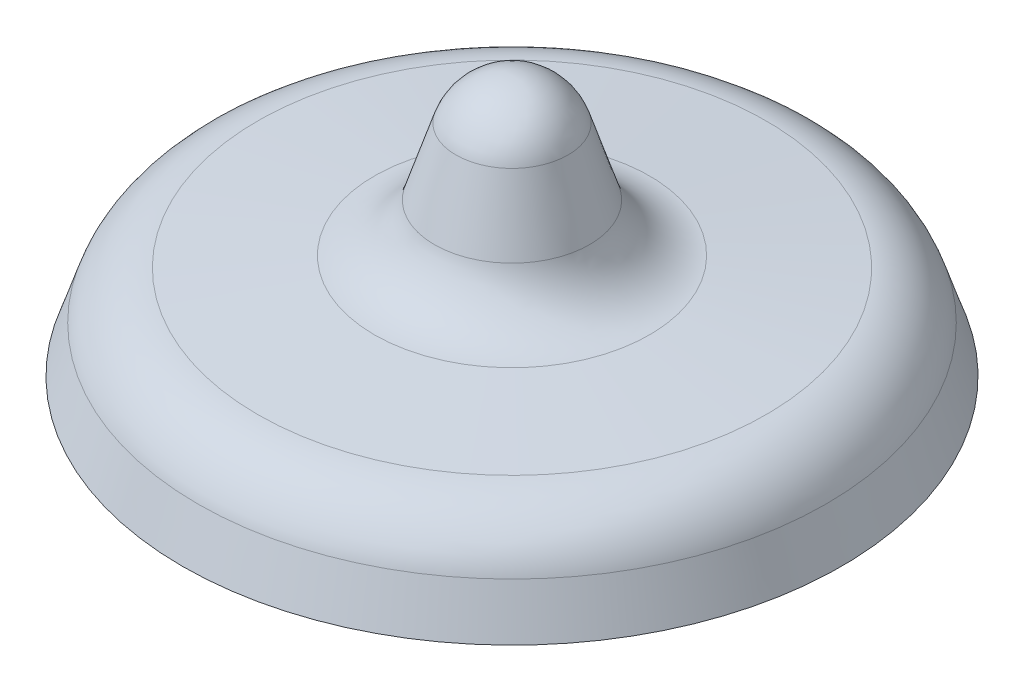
ISO-10303-21;
HEADER;
FILE_DESCRIPTION(('STEP AP214'),'2;1');
FILE_NAME('part.step','',(''),(''),'','','');
FILE_SCHEMA(('AUTOMOTIVE_DESIGN { 1 0 10303 214 1 1 1 1 }'));
ENDSEC;
DATA;
#1=APPLICATION_CONTEXT('core data for automotive mechanical design processes');
#2=APPLICATION_PROTOCOL_DEFINITION('international standard','automotive_design',2000,#1);
#3=PRODUCT_CONTEXT('',#1,'mechanical');
#4=PRODUCT('Part','Part','',(#3));
#5=PRODUCT_RELATED_PRODUCT_CATEGORY('part','',(#4));
#6=PRODUCT_DEFINITION_FORMATION('','',#4);
#7=PRODUCT_DEFINITION_CONTEXT('part definition',#1,'design');
#8=PRODUCT_DEFINITION('design','',#6,#7);
#9=PRODUCT_DEFINITION_SHAPE('','',#8);
#10=(LENGTH_UNIT() NAMED_UNIT(*) SI_UNIT(.MILLI.,.METRE.));
#11=(NAMED_UNIT(*) PLANE_ANGLE_UNIT() SI_UNIT($,.RADIAN.));
#12=(NAMED_UNIT(*) SI_UNIT($,.STERADIAN.) SOLID_ANGLE_UNIT());
#13=UNCERTAINTY_MEASURE_WITH_UNIT(LENGTH_MEASURE(1.E-05),#10,'distance_accuracy_value','');
#14=(GEOMETRIC_REPRESENTATION_CONTEXT(3) GLOBAL_UNCERTAINTY_ASSIGNED_CONTEXT((#13)) GLOBAL_UNIT_ASSIGNED_CONTEXT((#10,
#11,#12)) REPRESENTATION_CONTEXT('',''));
#15=CARTESIAN_POINT('',(0.,0.,0.));
#16=DIRECTION('',(0.,0.,1.));
#17=DIRECTION('',(1.,0.,0.));
#18=AXIS2_PLACEMENT_3D('',#15,#16,#17);
#19=CARTESIAN_POINT('',(0.,0.,0.));
#20=DIRECTION('',(0.,1.,0.));
#21=DIRECTION('',(0.,0.,1.));
#22=AXIS2_PLACEMENT_3D('',#19,#20,#21);
#23=PLANE('',#22);
#24=CARTESIAN_POINT('',(0.,0.,0.));
#25=DIRECTION('',(0.,1.,0.));
#26=DIRECTION('',(0.,0.,1.));
#27=AXIS2_PLACEMENT_3D('',#24,#25,#26);
#28=CIRCLE('',#27,111.581714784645);
#29=CARTESIAN_POINT('',(0.,0.,111.581714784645));
#30=VERTEX_POINT('',#29);
#31=EDGE_CURVE('E10',#30,#30,#28,.T.);
#32=ORIENTED_EDGE('',*,*,#31,.F.);
#33=EDGE_LOOP('',(#32));
#34=FACE_BOUND('',#33,.T.);
#35=ADVANCED_FACE('F42',(#34),#23,.F.);
#36=CARTESIAN_POINT('',(0.,0.,0.));
#37=DIRECTION('',(0.,-1.,0.));
#38=DIRECTION('',(0.,0.,-1.));
#39=AXIS2_PLACEMENT_3D('',#36,#37,#38);
#40=CONICAL_SURFACE('',#39,111.581714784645,0.320474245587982);
#41=CARTESIAN_POINT('',(0.,15.686559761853,0.));
#42=DIRECTION('',(0.,1.,0.));
#43=DIRECTION('',(0.,0.,1.));
#44=AXIS2_PLACEMENT_3D('',#41,#42,#43);
#45=CIRCLE('',#44,106.375097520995);
#46=CARTESIAN_POINT('',(0.,15.686559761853,106.375097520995));
#47=VERTEX_POINT('',#46);
#48=EDGE_CURVE('E49',#47,#47,#45,.T.);
#49=ORIENTED_EDGE('',*,*,#48,.F.);
#50=EDGE_LOOP('',(#49));
#51=FACE_BOUND('',#50,.T.);
#52=ORIENTED_EDGE('',*,*,#31,.T.);
#53=EDGE_LOOP('',(#52));
#54=FACE_BOUND('',#53,.T.);
#55=ADVANCED_FACE('F93',(#51,#54),#40,.T.);
#56=CARTESIAN_POINT('',(0.,8.24328760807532,0.));
#57=DIRECTION('',(0.,1.,0.));
#58=DIRECTION('',(0.,0.,1.));
#59=AXIS2_PLACEMENT_3D('',#56,#57,#58);
#60=TOROIDAL_SURFACE('',#59,83.9499167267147,23.6281830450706);
#61=CARTESIAN_POINT('',(0.,31.7726805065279,0.));
#62=DIRECTION('',(0.,1.,0.));
#63=DIRECTION('',(0.,0.,1.));
#64=AXIS2_PLACEMENT_3D('',#61,#62,#63);
#65=CIRCLE('',#64,86.108319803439);
#66=CARTESIAN_POINT('',(0.,31.7726805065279,86.108319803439));
#67=VERTEX_POINT('',#66);
#68=EDGE_CURVE('E54',#67,#67,#65,.T.);
#69=ORIENTED_EDGE('',*,*,#68,.F.);
#70=EDGE_LOOP('',(#69));
#71=FACE_BOUND('',#70,.T.);
#72=ORIENTED_EDGE('',*,*,#48,.T.);
#73=EDGE_LOOP('',(#72));
#74=FACE_BOUND('',#73,.T.);
#75=ADVANCED_FACE('F88',(#71,#74),#60,.T.);
#76=CARTESIAN_POINT('',(0.,31.7726805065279,0.));
#77=DIRECTION('',(0.,-1.,0.));
#78=DIRECTION('',(0.,0.,-1.));
#79=AXIS2_PLACEMENT_3D('',#76,#77,#78);
#80=CONICAL_SURFACE('',#79,86.108319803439,1.47932013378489);
#81=CARTESIAN_POINT('',(0.,35.3968974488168,0.));
#82=DIRECTION('',(0.,1.,0.));
#83=DIRECTION('',(0.,0.,1.));
#84=AXIS2_PLACEMENT_3D('',#81,#82,#83);
#85=CIRCLE('',#84,46.5996546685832);
#86=CARTESIAN_POINT('',(0.,35.3968974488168,46.5996546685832));
#87=VERTEX_POINT('',#86);
#88=EDGE_CURVE('E59',#87,#87,#85,.T.);
#89=ORIENTED_EDGE('',*,*,#88,.F.);
#90=EDGE_LOOP('',(#89));
#91=FACE_BOUND('',#90,.T.);
#92=ORIENTED_EDGE('',*,*,#68,.T.);
#93=EDGE_LOOP('',(#92));
#94=FACE_BOUND('',#93,.T.);
#95=ADVANCED_FACE('F82',(#91,#94),#80,.T.);
#96=CARTESIAN_POINT('',(0.,58.9262903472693,0.));
#97=DIRECTION('',(0.,1.,0.));
#98=DIRECTION('',(0.,0.,1.));
#99=AXIS2_PLACEMENT_3D('',#96,#97,#98);
#100=TOROIDAL_SURFACE('',#99,48.7580577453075,23.6281830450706);
#101=CARTESIAN_POINT('',(0.,51.6723724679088,0.));
#102=DIRECTION('',(0.,1.,0.));
#103=DIRECTION('',(0.,0.,1.));
#104=AXIS2_PLACEMENT_3D('',#101,#102,#103);
#105=CIRCLE('',#104,26.2709123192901);
#106=CARTESIAN_POINT('',(0.,51.6723724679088,26.2709123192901));
#107=VERTEX_POINT('',#106);
#108=EDGE_CURVE('E64',#107,#107,#105,.T.);
#109=ORIENTED_EDGE('',*,*,#108,.F.);
#110=EDGE_LOOP('',(#109));
#111=FACE_BOUND('',#110,.T.);
#112=ORIENTED_EDGE('',*,*,#88,.T.);
#113=EDGE_LOOP('',(#112));
#114=FACE_BOUND('',#113,.T.);
#115=ADVANCED_FACE('F76',(#111,#114),#100,.F.);
#116=CARTESIAN_POINT('',(0.,51.6723724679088,0.));
#117=DIRECTION('',(0.,-1.,0.));
#118=DIRECTION('',(0.,0.,-1.));
#119=AXIS2_PLACEMENT_3D('',#116,#117,#118);
#120=CONICAL_SURFACE('',#119,26.2709123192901,0.312042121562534);
#121=CARTESIAN_POINT('',(0.,74.303157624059,0.));
#122=DIRECTION('',(0.,1.,0.));
#123=DIRECTION('',(0.,0.,1.));
#124=AXIS2_PLACEMENT_3D('',#121,#122,#123);
#125=CIRCLE('',#124,18.9706590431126);
#126=CARTESIAN_POINT('',(0.,74.303157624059,18.9706590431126));
#127=VERTEX_POINT('',#126);
#128=EDGE_CURVE('E67',#127,#127,#125,.T.);
#129=ORIENTED_EDGE('',*,*,#128,.F.);
#130=EDGE_LOOP('',(#129));
#131=FACE_BOUND('',#130,.T.);
#132=ORIENTED_EDGE('',*,*,#108,.T.);
#133=EDGE_LOOP('',(#132));
#134=FACE_BOUND('',#133,.T.);
#135=ADVANCED_FACE('F73',(#131,#134),#120,.T.);
#136=CARTESIAN_POINT('',(0.,68.1835901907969,0.));
#137=DIRECTION('',(0.,1.,0.));
#138=DIRECTION('',(1.,0.,0.));
#139=AXIS2_PLACEMENT_3D('',#136,#137,#138);
#140=SPHERICAL_SURFACE('',#139,19.9332639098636);
#141=ORIENTED_EDGE('',*,*,#128,.T.);
#142=EDGE_LOOP('',(#141));
#143=FACE_BOUND('',#142,.T.);
#144=ADVANCED_FACE('F71',(#143),#140,.T.);
#145=CLOSED_SHELL('',(#35,#55,#75,#95,#115,#135,#144));
#146=MANIFOLD_SOLID_BREP('B2',#145);
#147=ADVANCED_BREP_SHAPE_REPRESENTATION('',(#18,#146),#14);
#148=SHAPE_DEFINITION_REPRESENTATION(#9,#147);
ENDSEC;
END-ISO-10303-21;
